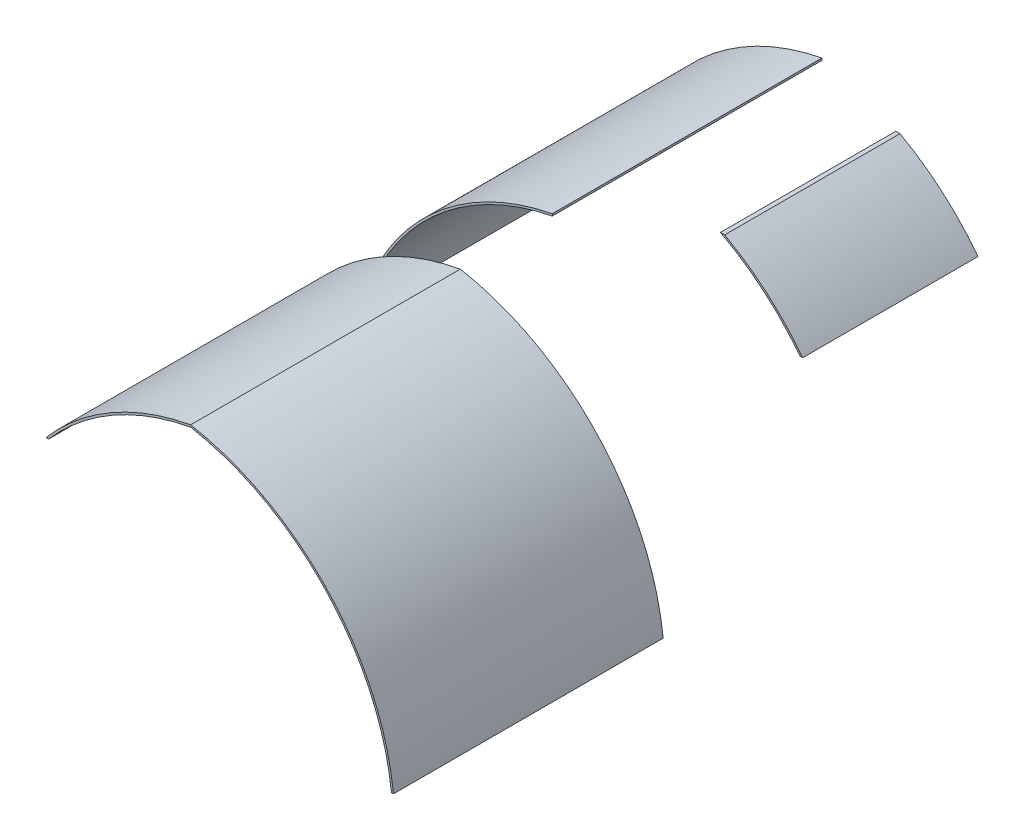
ISO-10303-21;
HEADER;
FILE_DESCRIPTION(('STEP AP214'),'2;1');
FILE_NAME('part.step','',(''),(''),'','','');
FILE_SCHEMA(('AUTOMOTIVE_DESIGN { 1 0 10303 214 1 1 1 1 }'));
ENDSEC;
DATA;
#1=APPLICATION_CONTEXT('core data for automotive mechanical design processes');
#2=APPLICATION_PROTOCOL_DEFINITION('international standard','automotive_design',2000,#1);
#3=PRODUCT_CONTEXT('',#1,'mechanical');
#4=PRODUCT('Part','Part','',(#3));
#5=PRODUCT_RELATED_PRODUCT_CATEGORY('part','',(#4));
#6=PRODUCT_DEFINITION_FORMATION('','',#4);
#7=PRODUCT_DEFINITION_CONTEXT('part definition',#1,'design');
#8=PRODUCT_DEFINITION('design','',#6,#7);
#9=PRODUCT_DEFINITION_SHAPE('','',#8);
#10=(LENGTH_UNIT() NAMED_UNIT(*) SI_UNIT(.MILLI.,.METRE.));
#11=(NAMED_UNIT(*) PLANE_ANGLE_UNIT() SI_UNIT($,.RADIAN.));
#12=(NAMED_UNIT(*) SI_UNIT($,.STERADIAN.) SOLID_ANGLE_UNIT());
#13=UNCERTAINTY_MEASURE_WITH_UNIT(LENGTH_MEASURE(1.E-05),#10,'distance_accuracy_value','');
#14=(GEOMETRIC_REPRESENTATION_CONTEXT(3) GLOBAL_UNCERTAINTY_ASSIGNED_CONTEXT((#13)) GLOBAL_UNIT_ASSIGNED_CONTEXT((#10,
#11,#12)) REPRESENTATION_CONTEXT('',''));
#15=CARTESIAN_POINT('',(0.,0.,0.));
#16=DIRECTION('',(0.,0.,1.));
#17=DIRECTION('',(1.,0.,0.));
#18=AXIS2_PLACEMENT_3D('',#15,#16,#17);
#19=CARTESIAN_POINT('',(0.,0.,2900.));
#20=DIRECTION('',(0.,0.,-1.));
#21=DIRECTION('',(-1.,0.,0.));
#22=AXIS2_PLACEMENT_3D('',#19,#20,#21);
#23=PLANE('',#22);
#24=CARTESIAN_POINT('',(351.335117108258,-91.3706169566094,2900.));
#25=DIRECTION('',(0.,0.,-1.));
#26=DIRECTION('',(-1.,0.,0.));
#27=AXIS2_PLACEMENT_3D('',#24,#25,#26);
#28=CIRCLE('',#27,1848.03652149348);
#29=CARTESIAN_POINT('',(-1054.09683954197,1108.6293830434,2900.));
#30=VERTEX_POINT('',#29);
#31=CARTESIAN_POINT('',(18.2985956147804,1726.40980436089,2900.));
#32=VERTEX_POINT('',#31);
#33=EDGE_CURVE('E67',#30,#32,#28,.T.);
#34=ORIENTED_EDGE('',*,*,#33,.T.);
#35=CARTESIAN_POINT('',(-314.737925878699,-91.3706169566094,2900.));
#36=DIRECTION('',(0.,0.,-1.));
#37=DIRECTION('',(-1.,0.,0.));
#38=AXIS2_PLACEMENT_3D('',#35,#36,#37);
#39=CIRCLE('',#38,1848.03652149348);
#40=CARTESIAN_POINT('',(1522.44442347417,108.629383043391,2900.));
#41=VERTEX_POINT('',#40);
#42=EDGE_CURVE('E104',#32,#41,#39,.T.);
#43=ORIENTED_EDGE('',*,*,#42,.T.);
#44=DIRECTION('',(1.,0.,0.));
#45=VECTOR('',#44,1.);
#46=CARTESIAN_POINT('',(0.,108.629383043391,2900.));
#47=LINE('',#46,#45);
#48=CARTESIAN_POINT('',(1507.35507096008,108.629383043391,2900.));
#49=VERTEX_POINT('',#48);
#50=EDGE_CURVE('E136',#49,#41,#47,.T.);
#51=ORIENTED_EDGE('',*,*,#50,.F.);
#52=CARTESIAN_POINT('',(-314.737925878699,-91.3706169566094,2900.));
#53=DIRECTION('',(0.,0.,-1.));
#54=DIRECTION('',(-1.,0.,0.));
#55=AXIS2_PLACEMENT_3D('',#52,#53,#54);
#56=CIRCLE('',#55,1833.03652149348);
#57=CARTESIAN_POINT('',(18.2985956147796,1711.15804147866,2900.));
#58=VERTEX_POINT('',#57);
#59=EDGE_CURVE('E143',#49,#58,#56,.F.);
#60=ORIENTED_EDGE('',*,*,#59,.T.);
#61=CARTESIAN_POINT('',(351.335117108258,-91.3706169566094,2900.));
#62=DIRECTION('',(0.,0.,-1.));
#63=DIRECTION('',(-1.,0.,0.));
#64=AXIS2_PLACEMENT_3D('',#61,#62,#63);
#65=CIRCLE('',#64,1833.03652149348);
#66=CARTESIAN_POINT('',(-1034.31378832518,1108.6293830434,2900.));
#67=VERTEX_POINT('',#66);
#68=EDGE_CURVE('E81',#58,#67,#65,.F.);
#69=ORIENTED_EDGE('',*,*,#68,.T.);
#70=DIRECTION('',(-1.,0.,0.));
#71=VECTOR('',#70,1.);
#72=CARTESIAN_POINT('',(14.9999999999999,1108.6293830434,2900.));
#73=LINE('',#72,#71);
#74=EDGE_CURVE('E135',#67,#30,#73,.T.);
#75=ORIENTED_EDGE('',*,*,#74,.T.);
#76=EDGE_LOOP('',(#34,#43,#51,#60,#69,#75));
#77=FACE_BOUND('',#76,.T.);
#78=ADVANCED_FACE('F43',(#77),#23,.T.);
#79=CARTESIAN_POINT('',(0.,0.,4900.));
#80=DIRECTION('',(0.,0.,-1.));
#81=DIRECTION('',(-1.,0.,0.));
#82=AXIS2_PLACEMENT_3D('',#79,#80,#81);
#83=PLANE('',#82);
#84=CARTESIAN_POINT('',(351.335117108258,-91.3706169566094,4900.));
#85=DIRECTION('',(0.,0.,-1.));
#86=DIRECTION('',(-1.,0.,0.));
#87=AXIS2_PLACEMENT_3D('',#84,#85,#86);
#88=CIRCLE('',#87,1833.03652149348);
#89=CARTESIAN_POINT('',(18.2985956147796,1711.15804147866,4900.));
#90=VERTEX_POINT('',#89);
#91=CARTESIAN_POINT('',(-1034.31378832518,1108.6293830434,4900.));
#92=VERTEX_POINT('',#91);
#93=EDGE_CURVE('E58',#90,#92,#88,.F.);
#94=ORIENTED_EDGE('',*,*,#93,.F.);
#95=CARTESIAN_POINT('',(-314.737925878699,-91.3706169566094,4900.));
#96=DIRECTION('',(0.,0.,-1.));
#97=DIRECTION('',(-1.,0.,0.));
#98=AXIS2_PLACEMENT_3D('',#95,#96,#97);
#99=CIRCLE('',#98,1833.03652149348);
#100=CARTESIAN_POINT('',(1507.35507096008,108.629383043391,4900.));
#101=VERTEX_POINT('',#100);
#102=EDGE_CURVE('E122',#101,#90,#99,.F.);
#103=ORIENTED_EDGE('',*,*,#102,.F.);
#104=DIRECTION('',(1.,0.,0.));
#105=VECTOR('',#104,1.);
#106=CARTESIAN_POINT('',(0.,108.629383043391,4900.));
#107=LINE('',#106,#105);
#108=CARTESIAN_POINT('',(1522.44442347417,108.629383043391,4900.));
#109=VERTEX_POINT('',#108);
#110=EDGE_CURVE('E120',#101,#109,#107,.T.);
#111=ORIENTED_EDGE('',*,*,#110,.T.);
#112=CARTESIAN_POINT('',(-314.737925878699,-91.3706169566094,4900.));
#113=DIRECTION('',(0.,0.,-1.));
#114=DIRECTION('',(-1.,0.,0.));
#115=AXIS2_PLACEMENT_3D('',#112,#113,#114);
#116=CIRCLE('',#115,1848.03652149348);
#117=CARTESIAN_POINT('',(18.2985956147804,1726.40980436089,4900.));
#118=VERTEX_POINT('',#117);
#119=EDGE_CURVE('E117',#118,#109,#116,.T.);
#120=ORIENTED_EDGE('',*,*,#119,.F.);
#121=CARTESIAN_POINT('',(351.335117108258,-91.3706169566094,4900.));
#122=DIRECTION('',(0.,0.,-1.));
#123=DIRECTION('',(-1.,0.,0.));
#124=AXIS2_PLACEMENT_3D('',#121,#122,#123);
#125=CIRCLE('',#124,1848.03652149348);
#126=CARTESIAN_POINT('',(-1054.09683954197,1108.6293830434,4900.));
#127=VERTEX_POINT('',#126);
#128=EDGE_CURVE('E108',#127,#118,#125,.T.);
#129=ORIENTED_EDGE('',*,*,#128,.F.);
#130=DIRECTION('',(-1.,0.,0.));
#131=VECTOR('',#130,1.);
#132=CARTESIAN_POINT('',(14.9999999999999,1108.6293830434,4900.));
#133=LINE('',#132,#131);
#134=EDGE_CURVE('E12',#92,#127,#133,.T.);
#135=ORIENTED_EDGE('',*,*,#134,.F.);
#136=EDGE_LOOP('',(#94,#103,#111,#120,#129,#135));
#137=FACE_BOUND('',#136,.T.);
#138=ADVANCED_FACE('F118',(#137),#83,.F.);
#139=CARTESIAN_POINT('',(351.335117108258,-91.3706169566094,6000.));
#140=DIRECTION('',(0.,0.,-1.));
#141=DIRECTION('',(-1.,0.,0.));
#142=AXIS2_PLACEMENT_3D('',#139,#140,#141);
#143=CYLINDRICAL_SURFACE('',#142,1848.03652149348);
#144=DIRECTION('',(0.,0.,-1.));
#145=VECTOR('',#144,1.);
#146=CARTESIAN_POINT('',(-1054.09683954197,1108.6293830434,6000.));
#147=LINE('',#146,#145);
#148=EDGE_CURVE('E112',#127,#30,#147,.T.);
#149=ORIENTED_EDGE('',*,*,#148,.F.);
#150=ORIENTED_EDGE('',*,*,#128,.T.);
#151=DIRECTION('',(0.,0.,-1.));
#152=VECTOR('',#151,1.);
#153=CARTESIAN_POINT('',(18.2985956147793,1726.40980436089,6000.));
#154=LINE('',#153,#152);
#155=EDGE_CURVE('E111',#118,#32,#154,.T.);
#156=ORIENTED_EDGE('',*,*,#155,.T.);
#157=ORIENTED_EDGE('',*,*,#33,.F.);
#158=EDGE_LOOP('',(#149,#150,#156,#157));
#159=FACE_BOUND('',#158,.T.);
#160=ADVANCED_FACE('F45',(#159),#143,.T.);
#161=CARTESIAN_POINT('',(-314.737925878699,-91.3706169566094,6000.));
#162=DIRECTION('',(0.,0.,-1.));
#163=DIRECTION('',(-1.,0.,0.));
#164=AXIS2_PLACEMENT_3D('',#161,#162,#163);
#165=CYLINDRICAL_SURFACE('',#164,1848.03652149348);
#166=ORIENTED_EDGE('',*,*,#42,.F.);
#167=ORIENTED_EDGE('',*,*,#155,.F.);
#168=ORIENTED_EDGE('',*,*,#119,.T.);
#169=DIRECTION('',(0.,0.,-1.));
#170=VECTOR('',#169,1.);
#171=CARTESIAN_POINT('',(1522.44442347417,108.629383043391,6000.));
#172=LINE('',#171,#170);
#173=EDGE_CURVE('E90',#41,#109,#172,.F.);
#174=ORIENTED_EDGE('',*,*,#173,.F.);
#175=EDGE_LOOP('',(#166,#167,#168,#174));
#176=FACE_BOUND('',#175,.T.);
#177=ADVANCED_FACE('F124',(#176),#165,.T.);
#178=CARTESIAN_POINT('',(-314.737925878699,-91.3706169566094,6000.));
#179=DIRECTION('',(0.,0.,-1.));
#180=DIRECTION('',(-1.,0.,0.));
#181=AXIS2_PLACEMENT_3D('',#178,#179,#180);
#182=CYLINDRICAL_SURFACE('',#181,1833.03652149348);
#183=ORIENTED_EDGE('',*,*,#59,.F.);
#184=DIRECTION('',(0.,0.,-1.));
#185=VECTOR('',#184,1.);
#186=CARTESIAN_POINT('',(1507.35507096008,108.629383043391,6000.));
#187=LINE('',#186,#185);
#188=EDGE_CURVE('E128',#101,#49,#187,.T.);
#189=ORIENTED_EDGE('',*,*,#188,.F.);
#190=ORIENTED_EDGE('',*,*,#102,.T.);
#191=DIRECTION('',(0.,0.,-1.));
#192=VECTOR('',#191,1.);
#193=CARTESIAN_POINT('',(18.2985956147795,1711.15804147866,6000.));
#194=LINE('',#193,#192);
#195=EDGE_CURVE('E130',#90,#58,#194,.T.);
#196=ORIENTED_EDGE('',*,*,#195,.T.);
#197=EDGE_LOOP('',(#183,#189,#190,#196));
#198=FACE_BOUND('',#197,.T.);
#199=ADVANCED_FACE('F152',(#198),#182,.F.);
#200=CARTESIAN_POINT('',(351.335117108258,-91.3706169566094,6000.));
#201=DIRECTION('',(0.,0.,-1.));
#202=DIRECTION('',(-1.,0.,0.));
#203=AXIS2_PLACEMENT_3D('',#200,#201,#202);
#204=CYLINDRICAL_SURFACE('',#203,1833.03652149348);
#205=ORIENTED_EDGE('',*,*,#93,.T.);
#206=DIRECTION('',(0.,0.,-1.));
#207=VECTOR('',#206,1.);
#208=CARTESIAN_POINT('',(-1034.31378832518,1108.6293830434,6000.));
#209=LINE('',#208,#207);
#210=EDGE_CURVE('E51',#67,#92,#209,.F.);
#211=ORIENTED_EDGE('',*,*,#210,.F.);
#212=ORIENTED_EDGE('',*,*,#68,.F.);
#213=ORIENTED_EDGE('',*,*,#195,.F.);
#214=EDGE_LOOP('',(#205,#211,#212,#213));
#215=FACE_BOUND('',#214,.T.);
#216=ADVANCED_FACE('F139',(#215),#204,.F.);
#217=CARTESIAN_POINT('',(0.,108.629383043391,0.));
#218=DIRECTION('',(0.,-1.,0.));
#219=DIRECTION('',(0.,0.,-1.));
#220=AXIS2_PLACEMENT_3D('',#217,#218,#219);
#221=PLANE('',#220);
#222=ORIENTED_EDGE('',*,*,#188,.T.);
#223=ORIENTED_EDGE('',*,*,#50,.T.);
#224=ORIENTED_EDGE('',*,*,#173,.T.);
#225=ORIENTED_EDGE('',*,*,#110,.F.);
#226=EDGE_LOOP('',(#222,#223,#224,#225));
#227=FACE_BOUND('',#226,.T.);
#228=ADVANCED_FACE('F153',(#227),#221,.T.);
#229=CARTESIAN_POINT('',(14.9999999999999,1108.6293830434,1.23082586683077E-13));
#230=DIRECTION('',(0.,-1.,0.));
#231=DIRECTION('',(0.,0.,-1.));
#232=AXIS2_PLACEMENT_3D('',#229,#230,#231);
#233=PLANE('',#232);
#234=ORIENTED_EDGE('',*,*,#148,.T.);
#235=ORIENTED_EDGE('',*,*,#74,.F.);
#236=ORIENTED_EDGE('',*,*,#210,.T.);
#237=ORIENTED_EDGE('',*,*,#134,.T.);
#238=EDGE_LOOP('',(#234,#235,#236,#237));
#239=FACE_BOUND('',#238,.T.);
#240=ADVANCED_FACE('F138',(#239),#233,.T.);
#241=CLOSED_SHELL('',(#78,#138,#160,#177,#199,#216,#228,#240));
#242=MANIFOLD_SOLID_BREP('B2',#241);
#243=CARTESIAN_POINT('',(0.,0.,0.));
#244=DIRECTION('',(1.,0.,0.));
#245=DIRECTION('',(0.,0.,-1.));
#246=AXIS2_PLACEMENT_3D('',#243,#244,#245);
#247=PLANE('',#246);
#248=DIRECTION('',(0.,0.,-1.));
#249=VECTOR('',#248,1.);
#250=CARTESIAN_POINT('',(0.,1707.68094556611,6000.));
#251=LINE('',#250,#249);
#252=CARTESIAN_POINT('',(0.,1707.68094556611,2200.));
#253=VERTEX_POINT('',#252);
#254=CARTESIAN_POINT('',(0.,1707.68094556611,200.));
#255=VERTEX_POINT('',#254);
#256=EDGE_CURVE('E288',#253,#255,#251,.T.);
#257=ORIENTED_EDGE('',*,*,#256,.T.);
#258=DIRECTION('',(0.,1.,0.));
#259=VECTOR('',#258,1.);
#260=CARTESIAN_POINT('',(0.,0.,200.));
#261=LINE('',#260,#259);
#262=CARTESIAN_POINT('',(0.,1722.9619380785,200.));
#263=VERTEX_POINT('',#262);
#264=EDGE_CURVE('E240',#255,#263,#261,.T.);
#265=ORIENTED_EDGE('',*,*,#264,.T.);
#266=DIRECTION('',(0.,0.,-1.));
#267=VECTOR('',#266,1.);
#268=CARTESIAN_POINT('',(0.,1722.9619380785,6000.));
#269=LINE('',#268,#267);
#270=CARTESIAN_POINT('',(0.,1722.9619380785,2200.));
#271=VERTEX_POINT('',#270);
#272=EDGE_CURVE('E299',#263,#271,#269,.F.);
#273=ORIENTED_EDGE('',*,*,#272,.T.);
#274=DIRECTION('',(0.,1.,0.));
#275=VECTOR('',#274,1.);
#276=CARTESIAN_POINT('',(0.,0.,2200.));
#277=LINE('',#276,#275);
#278=EDGE_CURVE('E302',#253,#271,#277,.T.);
#279=ORIENTED_EDGE('',*,*,#278,.F.);
#280=EDGE_LOOP('',(#257,#265,#273,#279));
#281=FACE_BOUND('',#280,.T.);
#282=ADVANCED_FACE('F233',(#281),#247,.T.);
#283=CARTESIAN_POINT('',(351.335117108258,-91.3706169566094,6000.));
#284=DIRECTION('',(0.,0.,-1.));
#285=DIRECTION('',(-1.,0.,0.));
#286=AXIS2_PLACEMENT_3D('',#283,#284,#285);
#287=CYLINDRICAL_SURFACE('',#286,1833.03652149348);
#288=CARTESIAN_POINT('',(351.335117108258,-91.3706169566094,200.));
#289=DIRECTION('',(0.,0.,-1.));
#290=DIRECTION('',(0.,1.,0.));
#291=AXIS2_PLACEMENT_3D('',#288,#289,#290);
#292=CIRCLE('',#291,1833.03652149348);
#293=CARTESIAN_POINT('',(-1412.19058135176,408.629383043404,200.));
#294=VERTEX_POINT('',#293);
#295=EDGE_CURVE('E290',#255,#294,#292,.F.);
#296=ORIENTED_EDGE('',*,*,#295,.F.);
#297=ORIENTED_EDGE('',*,*,#256,.F.);
#298=CARTESIAN_POINT('',(351.335117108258,-91.3706169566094,2200.));
#299=DIRECTION('',(0.,0.,-1.));
#300=DIRECTION('',(-1.,0.,0.));
#301=AXIS2_PLACEMENT_3D('',#298,#299,#300);
#302=CIRCLE('',#301,1833.03652149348);
#303=CARTESIAN_POINT('',(-1412.19058135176,408.629383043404,2200.));
#304=VERTEX_POINT('',#303);
#305=EDGE_CURVE('E247',#253,#304,#302,.F.);
#306=ORIENTED_EDGE('',*,*,#305,.T.);
#307=DIRECTION('',(0.,0.,-1.));
#308=VECTOR('',#307,1.);
#309=CARTESIAN_POINT('',(-1412.19058135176,408.629383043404,6000.));
#310=LINE('',#309,#308);
#311=EDGE_CURVE('E41',#294,#304,#310,.F.);
#312=ORIENTED_EDGE('',*,*,#311,.F.);
#313=EDGE_LOOP('',(#296,#297,#306,#312));
#314=FACE_BOUND('',#313,.T.);
#315=ADVANCED_FACE('F286',(#314),#287,.F.);
#316=CARTESIAN_POINT('',(351.335117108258,-91.3706169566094,6000.));
#317=DIRECTION('',(0.,0.,-1.));
#318=DIRECTION('',(-1.,0.,0.));
#319=AXIS2_PLACEMENT_3D('',#316,#317,#318);
#320=CYLINDRICAL_SURFACE('',#319,1848.03652149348);
#321=CARTESIAN_POINT('',(351.335117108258,-91.3706169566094,200.));
#322=DIRECTION('',(0.,0.,-1.));
#323=DIRECTION('',(0.,1.,0.));
#324=AXIS2_PLACEMENT_3D('',#321,#322,#323);
#325=CIRCLE('',#324,1848.03652149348);
#326=CARTESIAN_POINT('',(-1427.77673569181,408.629383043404,200.));
#327=VERTEX_POINT('',#326);
#328=EDGE_CURVE('E255',#327,#263,#325,.T.);
#329=ORIENTED_EDGE('',*,*,#328,.F.);
#330=DIRECTION('',(0.,0.,-1.));
#331=VECTOR('',#330,1.);
#332=CARTESIAN_POINT('',(-1427.77673569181,408.629383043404,6000.));
#333=LINE('',#332,#331);
#334=CARTESIAN_POINT('',(-1427.77673569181,408.629383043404,2200.));
#335=VERTEX_POINT('',#334);
#336=EDGE_CURVE('E296',#335,#327,#333,.T.);
#337=ORIENTED_EDGE('',*,*,#336,.F.);
#338=CARTESIAN_POINT('',(351.335117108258,-91.3706169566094,2200.));
#339=DIRECTION('',(0.,0.,-1.));
#340=DIRECTION('',(-1.,0.,0.));
#341=AXIS2_PLACEMENT_3D('',#338,#339,#340);
#342=CIRCLE('',#341,1848.03652149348);
#343=EDGE_CURVE('E283',#335,#271,#342,.T.);
#344=ORIENTED_EDGE('',*,*,#343,.T.);
#345=ORIENTED_EDGE('',*,*,#272,.F.);
#346=EDGE_LOOP('',(#329,#337,#344,#345));
#347=FACE_BOUND('',#346,.T.);
#348=ADVANCED_FACE('F306',(#347),#320,.T.);
#349=CARTESIAN_POINT('',(14.9999999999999,408.629383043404,0.));
#350=DIRECTION('',(0.,-1.,0.));
#351=DIRECTION('',(0.,0.,-1.));
#352=AXIS2_PLACEMENT_3D('',#349,#350,#351);
#353=PLANE('',#352);
#354=ORIENTED_EDGE('',*,*,#336,.T.);
#355=DIRECTION('',(-1.,0.,0.));
#356=VECTOR('',#355,1.);
#357=CARTESIAN_POINT('',(14.9999999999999,408.629383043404,200.));
#358=LINE('',#357,#356);
#359=EDGE_CURVE('E278',#294,#327,#358,.T.);
#360=ORIENTED_EDGE('',*,*,#359,.F.);
#361=ORIENTED_EDGE('',*,*,#311,.T.);
#362=DIRECTION('',(-1.,0.,0.));
#363=VECTOR('',#362,1.);
#364=CARTESIAN_POINT('',(14.9999999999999,408.629383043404,2200.));
#365=LINE('',#364,#363);
#366=EDGE_CURVE('E276',#304,#335,#365,.T.);
#367=ORIENTED_EDGE('',*,*,#366,.T.);
#368=EDGE_LOOP('',(#354,#360,#361,#367));
#369=FACE_BOUND('',#368,.T.);
#370=ADVANCED_FACE('F275',(#369),#353,.T.);
#371=CARTESIAN_POINT('',(14.9999999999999,0.,200.));
#372=DIRECTION('',(0.,0.,-1.));
#373=DIRECTION('',(0.,1.,0.));
#374=AXIS2_PLACEMENT_3D('',#371,#372,#373);
#375=PLANE('',#374);
#376=ORIENTED_EDGE('',*,*,#328,.T.);
#377=ORIENTED_EDGE('',*,*,#264,.F.);
#378=ORIENTED_EDGE('',*,*,#295,.T.);
#379=ORIENTED_EDGE('',*,*,#359,.T.);
#380=EDGE_LOOP('',(#376,#377,#378,#379));
#381=FACE_BOUND('',#380,.T.);
#382=ADVANCED_FACE('F307',(#381),#375,.T.);
#383=CARTESIAN_POINT('',(14.9999999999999,0.,2200.));
#384=DIRECTION('',(0.,0.,-1.));
#385=DIRECTION('',(-1.,0.,0.));
#386=AXIS2_PLACEMENT_3D('',#383,#384,#385);
#387=PLANE('',#386);
#388=ORIENTED_EDGE('',*,*,#366,.F.);
#389=ORIENTED_EDGE('',*,*,#305,.F.);
#390=ORIENTED_EDGE('',*,*,#278,.T.);
#391=ORIENTED_EDGE('',*,*,#343,.F.);
#392=EDGE_LOOP('',(#388,#389,#390,#391));
#393=FACE_BOUND('',#392,.T.);
#394=ADVANCED_FACE('F281',(#393),#387,.F.);
#395=CLOSED_SHELL('',(#282,#315,#348,#370,#382,#394));
#396=MANIFOLD_SOLID_BREP('B6',#395);
#397=CARTESIAN_POINT('',(-314.737925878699,-91.3706169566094,6000.));
#398=DIRECTION('',(0.,0.,-1.));
#399=DIRECTION('',(-1.,0.,0.));
#400=AXIS2_PLACEMENT_3D('',#397,#398,#399);
#401=CYLINDRICAL_SURFACE('',#400,1848.03652149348);
#402=CARTESIAN_POINT('',(-314.737925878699,-91.3706169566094,200.));
#403=DIRECTION('',(0.,0.,1.));
#404=DIRECTION('',(1.,0.,0.));
#405=AXIS2_PLACEMENT_3D('',#402,#403,#404);
#406=CIRCLE('',#405,1848.03652149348);
#407=CARTESIAN_POINT('',(1156.92980648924,1026.40980436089,200.));
#408=VERTEX_POINT('',#407);
#409=CARTESIAN_POINT('',(578.584800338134,1526.40980436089,200.));
#410=VERTEX_POINT('',#409);
#411=EDGE_CURVE('E411',#408,#410,#406,.T.);
#412=ORIENTED_EDGE('',*,*,#411,.T.);
#413=DIRECTION('',(0.,0.,-1.));
#414=VECTOR('',#413,1.);
#415=CARTESIAN_POINT('',(578.584800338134,1526.40980436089,6000.));
#416=LINE('',#415,#414);
#417=CARTESIAN_POINT('',(578.584800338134,1526.40980436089,1500.));
#418=VERTEX_POINT('',#417);
#419=EDGE_CURVE('E231',#410,#418,#416,.F.);
#420=ORIENTED_EDGE('',*,*,#419,.T.);
#421=CARTESIAN_POINT('',(-314.737925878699,-91.3706169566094,1500.));
#422=DIRECTION('',(0.,0.,1.));
#423=DIRECTION('',(1.,0.,0.));
#424=AXIS2_PLACEMENT_3D('',#421,#422,#423);
#425=CIRCLE('',#424,1848.03652149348);
#426=CARTESIAN_POINT('',(1156.92980648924,1026.40980436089,1500.));
#427=VERTEX_POINT('',#426);
#428=EDGE_CURVE('E364',#427,#418,#425,.T.);
#429=ORIENTED_EDGE('',*,*,#428,.F.);
#430=DIRECTION('',(0.,0.,-1.));
#431=VECTOR('',#430,1.);
#432=CARTESIAN_POINT('',(1156.92980648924,1026.40980436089,6000.));
#433=LINE('',#432,#431);
#434=EDGE_CURVE('E413',#408,#427,#433,.F.);
#435=ORIENTED_EDGE('',*,*,#434,.F.);
#436=EDGE_LOOP('',(#412,#420,#429,#435));
#437=FACE_BOUND('',#436,.T.);
#438=ADVANCED_FACE('F356',(#437),#401,.T.);
#439=CARTESIAN_POINT('',(0.,1526.40980436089,0.));
#440=DIRECTION('',(0.,-1.,0.));
#441=DIRECTION('',(0.,0.,-1.));
#442=AXIS2_PLACEMENT_3D('',#439,#440,#441);
#443=PLANE('',#442);
#444=DIRECTION('',(1.,0.,0.));
#445=VECTOR('',#444,1.);
#446=CARTESIAN_POINT('',(0.,1526.40980436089,1500.));
#447=LINE('',#446,#445);
#448=CARTESIAN_POINT('',(547.125983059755,1526.40980436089,1500.));
#449=VERTEX_POINT('',#448);
#450=EDGE_CURVE('E400',#449,#418,#447,.T.);
#451=ORIENTED_EDGE('',*,*,#450,.T.);
#452=ORIENTED_EDGE('',*,*,#419,.F.);
#453=DIRECTION('',(1.,0.,0.));
#454=VECTOR('',#453,1.);
#455=CARTESIAN_POINT('',(0.,1526.40980436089,200.));
#456=LINE('',#455,#454);
#457=CARTESIAN_POINT('',(547.125983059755,1526.40980436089,200.));
#458=VERTEX_POINT('',#457);
#459=EDGE_CURVE('E376',#458,#410,#456,.T.);
#460=ORIENTED_EDGE('',*,*,#459,.F.);
#461=DIRECTION('',(0.,0.,-1.));
#462=VECTOR('',#461,1.);
#463=CARTESIAN_POINT('',(547.125983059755,1526.40980436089,6000.));
#464=LINE('',#463,#462);
#465=EDGE_CURVE('E405',#449,#458,#464,.T.);
#466=ORIENTED_EDGE('',*,*,#465,.F.);
#467=EDGE_LOOP('',(#451,#452,#460,#466));
#468=FACE_BOUND('',#467,.T.);
#469=ADVANCED_FACE('F404',(#468),#443,.F.);
#470=CARTESIAN_POINT('',(0.,0.,1500.));
#471=DIRECTION('',(0.,0.,1.));
#472=DIRECTION('',(1.,0.,0.));
#473=AXIS2_PLACEMENT_3D('',#470,#471,#472);
#474=PLANE('',#473);
#475=CARTESIAN_POINT('',(-314.737925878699,-91.3706169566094,1500.));
#476=DIRECTION('',(0.,0.,1.));
#477=DIRECTION('',(1.,0.,0.));
#478=AXIS2_PLACEMENT_3D('',#475,#476,#477);
#479=CIRCLE('',#478,1833.03652149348);
#480=CARTESIAN_POINT('',(1138.04898858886,1026.40980436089,1500.));
#481=VERTEX_POINT('',#480);
#482=EDGE_CURVE('E410',#449,#481,#479,.F.);
#483=ORIENTED_EDGE('',*,*,#482,.T.);
#484=DIRECTION('',(1.,0.,0.));
#485=VECTOR('',#484,1.);
#486=CARTESIAN_POINT('',(0.,1026.40980436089,1500.));
#487=LINE('',#486,#485);
#488=EDGE_CURVE('E423',#481,#427,#487,.T.);
#489=ORIENTED_EDGE('',*,*,#488,.T.);
#490=ORIENTED_EDGE('',*,*,#428,.T.);
#491=ORIENTED_EDGE('',*,*,#450,.F.);
#492=EDGE_LOOP('',(#483,#489,#490,#491));
#493=FACE_BOUND('',#492,.T.);
#494=ADVANCED_FACE('F421',(#493),#474,.T.);
#495=CARTESIAN_POINT('',(0.,1026.40980436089,0.));
#496=DIRECTION('',(0.,-1.,0.));
#497=DIRECTION('',(0.,0.,-1.));
#498=AXIS2_PLACEMENT_3D('',#495,#496,#497);
#499=PLANE('',#498);
#500=DIRECTION('',(0.,0.,-1.));
#501=VECTOR('',#500,1.);
#502=CARTESIAN_POINT('',(1138.04898858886,1026.40980436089,6000.));
#503=LINE('',#502,#501);
#504=CARTESIAN_POINT('',(1138.04898858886,1026.40980436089,200.));
#505=VERTEX_POINT('',#504);
#506=EDGE_CURVE('E399',#481,#505,#503,.T.);
#507=ORIENTED_EDGE('',*,*,#506,.T.);
#508=DIRECTION('',(1.,0.,0.));
#509=VECTOR('',#508,1.);
#510=CARTESIAN_POINT('',(0.,1026.40980436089,200.));
#511=LINE('',#510,#509);
#512=EDGE_CURVE('E371',#505,#408,#511,.T.);
#513=ORIENTED_EDGE('',*,*,#512,.T.);
#514=ORIENTED_EDGE('',*,*,#434,.T.);
#515=ORIENTED_EDGE('',*,*,#488,.F.);
#516=EDGE_LOOP('',(#507,#513,#514,#515));
#517=FACE_BOUND('',#516,.T.);
#518=ADVANCED_FACE('F428',(#517),#499,.T.);
#519=CARTESIAN_POINT('',(0.,0.,200.));
#520=DIRECTION('',(0.,0.,1.));
#521=DIRECTION('',(1.,0.,0.));
#522=AXIS2_PLACEMENT_3D('',#519,#520,#521);
#523=PLANE('',#522);
#524=ORIENTED_EDGE('',*,*,#459,.T.);
#525=ORIENTED_EDGE('',*,*,#411,.F.);
#526=ORIENTED_EDGE('',*,*,#512,.F.);
#527=CARTESIAN_POINT('',(-314.737925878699,-91.3706169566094,200.));
#528=DIRECTION('',(0.,0.,1.));
#529=DIRECTION('',(1.,0.,0.));
#530=AXIS2_PLACEMENT_3D('',#527,#528,#529);
#531=CIRCLE('',#530,1833.03652149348);
#532=EDGE_CURVE('E394',#458,#505,#531,.F.);
#533=ORIENTED_EDGE('',*,*,#532,.F.);
#534=EDGE_LOOP('',(#524,#525,#526,#533));
#535=FACE_BOUND('',#534,.T.);
#536=ADVANCED_FACE('F395',(#535),#523,.F.);
#537=CARTESIAN_POINT('',(-314.737925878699,-91.3706169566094,6000.));
#538=DIRECTION('',(0.,0.,-1.));
#539=DIRECTION('',(-1.,0.,0.));
#540=AXIS2_PLACEMENT_3D('',#537,#538,#539);
#541=CYLINDRICAL_SURFACE('',#540,1833.03652149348);
#542=ORIENTED_EDGE('',*,*,#482,.F.);
#543=ORIENTED_EDGE('',*,*,#465,.T.);
#544=ORIENTED_EDGE('',*,*,#532,.T.);
#545=ORIENTED_EDGE('',*,*,#506,.F.);
#546=EDGE_LOOP('',(#542,#543,#544,#545));
#547=FACE_BOUND('',#546,.T.);
#548=ADVANCED_FACE('F358',(#547),#541,.F.);
#549=CLOSED_SHELL('',(#438,#469,#494,#518,#536,#548));
#550=MANIFOLD_SOLID_BREP('B35',#549);
#551=ADVANCED_BREP_SHAPE_REPRESENTATION('',(#18,#242,#396,#550),#14);
#552=SHAPE_DEFINITION_REPRESENTATION(#9,#551);
ENDSEC;
END-ISO-10303-21;
